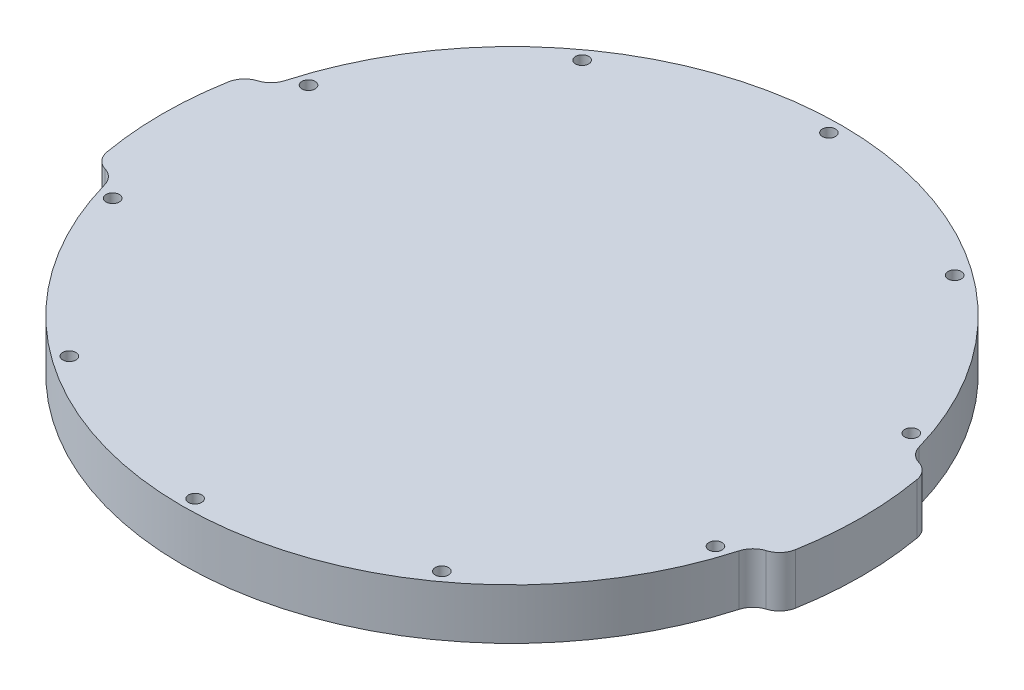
from build123d import *

# Parameters (mm, degrees)
SKETCH1_R           = 1.65
BOSS_EXTRUDE1_DEPTH = 12.7
FILLET1_R           = 5


with BuildPart() as part:
    # Sketch1 → Boss-Extrude1 (new body)
    with BuildSketch(Plane(origin=(0, 0, 0), x_dir=(1, 0, 0), z_dir=(0, 1, 0))):
        with BuildLine():
            ThreePointArc((-86.219918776, -15.202897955), (-87.55, 0), (-86.219918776, 15.202897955))
            ThreePointArc((-86.219918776, 15.202897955), (-84.101406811, 18.473379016), (-80.278914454, 19.23014285))
            ThreePointArc((-80.278914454, 19.23014285), (0, 82.55), (80.278914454, 19.23014285))
            ThreePointArc((80.278914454, 19.23014285), (84.101406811, 18.473379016), (86.219918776, 15.202897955))
            ThreePointArc((86.219918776, 15.202897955), (87.55, 0), (86.219918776, -15.202897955))
            ThreePointArc((86.219918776, -15.202897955), (84.101406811, -18.473379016), (80.278914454, -19.23014285))
            ThreePointArc((80.278914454, -19.23014285), (0, -82.55), (-80.278914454, -19.23014285))
            ThreePointArc((-80.278914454, -19.23014285), (-84.101406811, -18.473379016), (-86.219918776, -15.202897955))
        make_face()
        with Locations(Location((0, 79.35, 0), (0, 0, 270))):
            Circle(SKETCH1_R, mode=Mode.SUBTRACT)
        with Locations(Location((46.640759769, 64.195498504, 0), (0, 0, 270))):
            Circle(SKETCH1_R, mode=Mode.SUBTRACT)
        with Locations(Location((75.466334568, 24.520498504, 0), (0, 0, 270))):
            Circle(SKETCH1_R, mode=Mode.SUBTRACT)
        with Locations(Location((75.466334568, -24.520498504, 0), (0, 0, 270))):
            Circle(SKETCH1_R, mode=Mode.SUBTRACT)
        with Locations(Location((46.640759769, -64.195498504, 0), (0, 0, 270))):
            Circle(SKETCH1_R, mode=Mode.SUBTRACT)
        with Locations(Location((0, -79.35, 0), (0, 0, 270))):
            Circle(SKETCH1_R, mode=Mode.SUBTRACT)
        with Locations(Location((-46.640759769, -64.195498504, 0), (0, 0, 270))):
            Circle(SKETCH1_R, mode=Mode.SUBTRACT)
        with Locations(Location((-75.466334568, -24.520498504, 0), (0, 0, 270))):
            Circle(SKETCH1_R, mode=Mode.SUBTRACT)
        with Locations(Location((-75.466334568, 24.520498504, 0), (0, 0, 270))):
            Circle(SKETCH1_R, mode=Mode.SUBTRACT)
        with Locations(Location((-46.640759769, 64.195498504, 0), (0, 0, 270))):
            Circle(SKETCH1_R, mode=Mode.SUBTRACT)
    extrude(amount=BOSS_EXTRUDE1_DEPTH)

    # Fillet1
    fillet1_edges = [part.edges().sort_by_distance(p)[0] for p in [
        (-80.278914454, 6.35, -19.23014285),
        (80.278914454, 6.35, -19.23014285),
        (80.278914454, 6.35, 19.23014285),
        (-80.278914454, 6.35, 19.23014285),
    ]]
    fillet(fillet1_edges, radius=FILLET1_R)


solid = part.part
